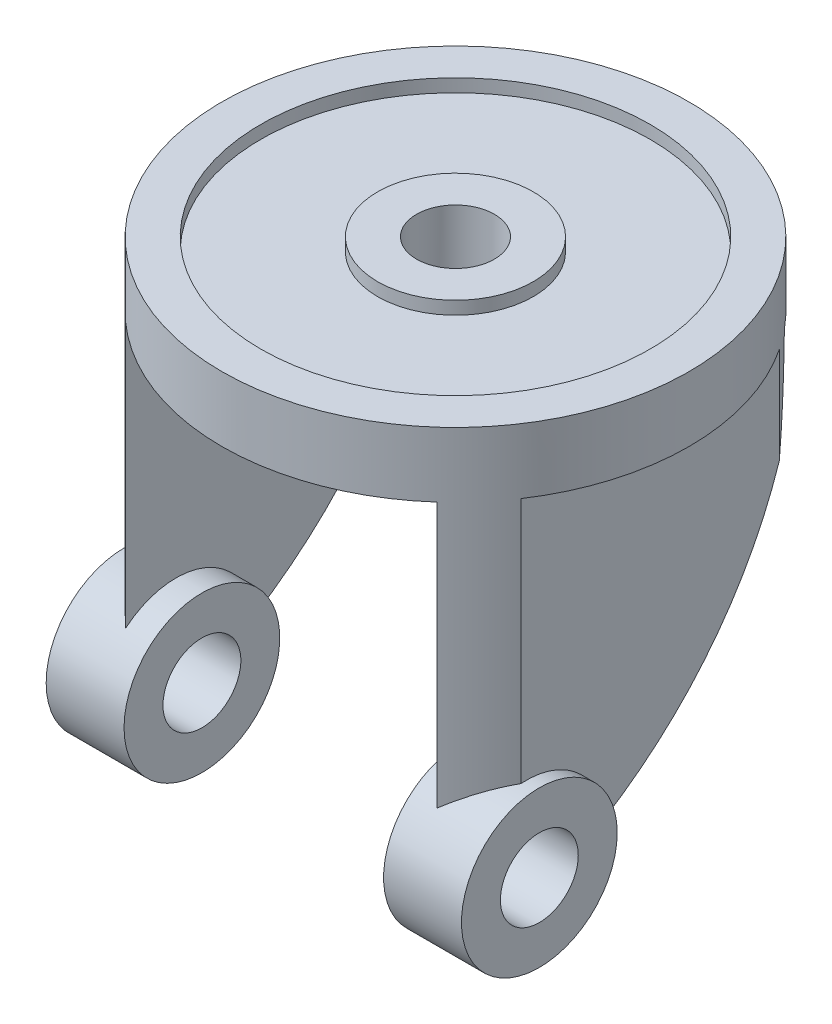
ISO-10303-21;
HEADER;
FILE_DESCRIPTION(('STEP AP214'),'2;1');
FILE_NAME('part.step','',(''),(''),'','','');
FILE_SCHEMA(('AUTOMOTIVE_DESIGN { 1 0 10303 214 1 1 1 1 }'));
ENDSEC;
DATA;
#1=APPLICATION_CONTEXT('core data for automotive mechanical design processes');
#2=APPLICATION_PROTOCOL_DEFINITION('international standard','automotive_design',2000,#1);
#3=PRODUCT_CONTEXT('',#1,'mechanical');
#4=PRODUCT('Part','Part','',(#3));
#5=PRODUCT_RELATED_PRODUCT_CATEGORY('part','',(#4));
#6=PRODUCT_DEFINITION_FORMATION('','',#4);
#7=PRODUCT_DEFINITION_CONTEXT('part definition',#1,'design');
#8=PRODUCT_DEFINITION('design','',#6,#7);
#9=PRODUCT_DEFINITION_SHAPE('','',#8);
#10=(LENGTH_UNIT() NAMED_UNIT(*) SI_UNIT(.MILLI.,.METRE.));
#11=(NAMED_UNIT(*) PLANE_ANGLE_UNIT() SI_UNIT($,.RADIAN.));
#12=(NAMED_UNIT(*) SI_UNIT($,.STERADIAN.) SOLID_ANGLE_UNIT());
#13=UNCERTAINTY_MEASURE_WITH_UNIT(LENGTH_MEASURE(1.E-05),#10,'distance_accuracy_value','');
#14=(GEOMETRIC_REPRESENTATION_CONTEXT(3) GLOBAL_UNCERTAINTY_ASSIGNED_CONTEXT((#13)) GLOBAL_UNIT_ASSIGNED_CONTEXT((#10,
#11,#12)) REPRESENTATION_CONTEXT('',''));
#15=CARTESIAN_POINT('',(0.,0.,0.));
#16=DIRECTION('',(0.,0.,1.));
#17=DIRECTION('',(1.,0.,0.));
#18=AXIS2_PLACEMENT_3D('',#15,#16,#17);
#19=CARTESIAN_POINT('',(0.,1.,-28.6156217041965));
#20=DIRECTION('',(0.,1.,0.));
#21=DIRECTION('',(0.,0.,1.));
#22=AXIS2_PLACEMENT_3D('',#19,#20,#21);
#23=CYLINDRICAL_SURFACE('',#22,9.);
#24=CARTESIAN_POINT('',(0.,90.,-28.6156217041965));
#25=DIRECTION('',(0.,1.,0.));
#26=DIRECTION('',(0.,0.,1.));
#27=AXIS2_PLACEMENT_3D('',#24,#25,#26);
#28=CIRCLE('',#27,9.);
#29=CARTESIAN_POINT('',(0.,90.,-19.6156217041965));
#30=VERTEX_POINT('',#29);
#31=EDGE_CURVE('E174',#30,#30,#28,.T.);
#32=ORIENTED_EDGE('',*,*,#31,.T.);
#33=EDGE_LOOP('',(#32));
#34=FACE_BOUND('',#33,.T.);
#35=CARTESIAN_POINT('',(0.,76.5,-28.6156217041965));
#36=DIRECTION('',(0.,-1.,0.));
#37=DIRECTION('',(0.,0.,-1.));
#38=AXIS2_PLACEMENT_3D('',#35,#36,#37);
#39=CIRCLE('',#38,9.);
#40=CARTESIAN_POINT('',(0.,76.5,-37.6156217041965));
#41=VERTEX_POINT('',#40);
#42=EDGE_CURVE('E38',#41,#41,#39,.F.);
#43=ORIENTED_EDGE('',*,*,#42,.F.);
#44=EDGE_LOOP('',(#43));
#45=FACE_BOUND('',#44,.T.);
#46=ADVANCED_FACE('F34',(#34,#45),#23,.F.);
#47=CARTESIAN_POINT('',(0.,90.,-28.6156217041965));
#48=DIRECTION('',(0.,1.,0.));
#49=DIRECTION('',(0.,0.,1.));
#50=AXIS2_PLACEMENT_3D('',#47,#48,#49);
#51=PLANE('',#50);
#52=ORIENTED_EDGE('',*,*,#31,.F.);
#53=EDGE_LOOP('',(#52));
#54=FACE_BOUND('',#53,.T.);
#55=CARTESIAN_POINT('',(0.,90.,-28.6156217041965));
#56=DIRECTION('',(0.,1.,0.));
#57=DIRECTION('',(0.,0.,1.));
#58=AXIS2_PLACEMENT_3D('',#55,#56,#57);
#59=CIRCLE('',#58,18.);
#60=CARTESIAN_POINT('',(0.,90.,-10.6156217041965));
#61=VERTEX_POINT('',#60);
#62=EDGE_CURVE('E368',#61,#61,#59,.T.);
#63=ORIENTED_EDGE('',*,*,#62,.T.);
#64=EDGE_LOOP('',(#63));
#65=FACE_BOUND('',#64,.T.);
#66=ADVANCED_FACE('F251',(#54,#65),#51,.T.);
#67=CARTESIAN_POINT('',(48.,0.,0.));
#68=DIRECTION('',(-1.,0.,0.));
#69=DIRECTION('',(0.,0.,1.));
#70=AXIS2_PLACEMENT_3D('',#67,#68,#69);
#71=CYLINDRICAL_SURFACE('',#70,18.);
#72=CARTESIAN_POINT('',(-30.,0.,0.));
#73=DIRECTION('',(-1.,0.,0.));
#74=DIRECTION('',(0.,0.,1.));
#75=AXIS2_PLACEMENT_3D('',#72,#73,#74);
#76=CIRCLE('',#75,18.);
#77=CARTESIAN_POINT('',(-30.,0.,18.));
#78=VERTEX_POINT('',#77);
#79=EDGE_CURVE('E124',#78,#78,#76,.T.);
#80=ORIENTED_EDGE('',*,*,#79,.T.);
#81=EDGE_LOOP('',(#80));
#82=FACE_BOUND('',#81,.T.);
#83=CARTESIAN_POINT('',(-48.,0.,0.));
#84=DIRECTION('',(1.,0.,0.));
#85=DIRECTION('',(0.,0.,-1.));
#86=AXIS2_PLACEMENT_3D('',#83,#84,#85);
#87=CIRCLE('',#86,18.);
#88=CARTESIAN_POINT('',(-48.,0.,-18.));
#89=VERTEX_POINT('',#88);
#90=EDGE_CURVE('E161',#89,#89,#87,.T.);
#91=ORIENTED_EDGE('',*,*,#90,.T.);
#92=EDGE_LOOP('',(#91));
#93=FACE_BOUND('',#92,.T.);
#94=CARTESIAN_POINT('',(-36.,0.,0.));
#95=DIRECTION('',(-1.,0.,0.));
#96=DIRECTION('',(0.,0.,-1.));
#97=AXIS2_PLACEMENT_3D('',#94,#95,#96);
#98=CIRCLE('',#97,18.);
#99=CARTESIAN_POINT('',(-36.,13.735330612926,11.6336018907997));
#100=VERTEX_POINT('',#99);
#101=CARTESIAN_POINT('',(-36.,1.26427087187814,-17.9555456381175));
#102=VERTEX_POINT('',#101);
#103=EDGE_CURVE('E309',#100,#102,#98,.T.);
#104=ORIENTED_EDGE('',*,*,#103,.F.);
#105=CARTESIAN_POINT('',(-45.,-17.9576513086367,1.23400140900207));
#106=CARTESIAN_POINT('',(-44.7881164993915,-17.9356977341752,1.55344461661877));
#107=CARTESIAN_POINT('',(-44.5731004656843,-17.9053703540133,1.87019320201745));
#108=CARTESIAN_POINT('',(-44.1373695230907,-17.8286692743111,2.49769093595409));
#109=CARTESIAN_POINT('',(-43.9166556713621,-17.7822985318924,2.8084411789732));
#110=CARTESIAN_POINT('',(-43.4702632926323,-17.6742630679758,3.42311076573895));
#111=CARTESIAN_POINT('',(-43.2445905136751,-17.6126152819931,3.72703726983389));
#112=CARTESIAN_POINT('',(-42.7885762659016,-17.4746601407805,4.32796759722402));
#113=CARTESIAN_POINT('',(-42.558234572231,-17.3983520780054,4.62497108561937));
#114=CARTESIAN_POINT('',(-41.8626138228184,-17.1489595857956,5.5029566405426));
#115=CARTESIAN_POINT('',(-41.3910741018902,-16.9549960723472,6.0732014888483));
#116=CARTESIAN_POINT('',(-40.435459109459,-16.5156578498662,7.18256428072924));
#117=CARTESIAN_POINT('',(-39.9513802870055,-16.2702684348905,7.72167326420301));
#118=CARTESIAN_POINT('',(-38.9853167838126,-15.737353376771,8.75595725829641));
#119=CARTESIAN_POINT('',(-38.5035122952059,-15.4508511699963,9.25182924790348));
#120=CARTESIAN_POINT('',(-37.5357681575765,-14.8342332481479,10.2113067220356));
#121=CARTESIAN_POINT('',(-37.0498285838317,-14.5041183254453,10.6749127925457));
#122=CARTESIAN_POINT('',(-36.077466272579,-13.8010195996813,11.5696183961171));
#123=CARTESIAN_POINT('',(-35.5910437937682,-13.4279772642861,12.0006721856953));
#124=CARTESIAN_POINT('',(-34.623540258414,-12.63947550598,12.8285023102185));
#125=CARTESIAN_POINT('',(-34.1424580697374,-12.2240252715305,13.225286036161));
#126=CARTESIAN_POINT('',(-33.3179975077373,-11.4651789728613,13.8827417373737));
#127=CARTESIAN_POINT('',(-32.9718889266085,-11.131834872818,14.1516335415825));
#128=CARTESIAN_POINT('',(-32.2893692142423,-10.4402951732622,14.6692478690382));
#129=CARTESIAN_POINT('',(-31.9529586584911,-10.0820981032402,14.9179691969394));
#130=CARTESIAN_POINT('',(-31.2947563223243,-9.33992106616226,15.3935001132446));
#131=CARTESIAN_POINT('',(-30.9729418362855,-8.95598362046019,15.6203443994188));
#132=CARTESIAN_POINT('',(-30.3491938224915,-8.15987052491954,16.0505813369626));
#133=CARTESIAN_POINT('',(-30.0472516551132,-7.74770730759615,16.2539842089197));
#134=CARTESIAN_POINT('',(-29.5744617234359,-7.04625366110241,16.5662377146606));
#135=CARTESIAN_POINT('',(-29.3954339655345,-6.76590784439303,16.6828368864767));
#136=CARTESIAN_POINT('',(-29.0514563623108,-6.19212412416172,16.9042053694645));
#137=CARTESIAN_POINT('',(-28.8865063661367,-5.89868636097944,17.0089748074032));
#138=CARTESIAN_POINT('',(-28.5740666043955,-5.29879068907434,17.2052986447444));
#139=CARTESIAN_POINT('',(-28.4265571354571,-4.99234801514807,17.2968679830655));
#140=CARTESIAN_POINT('',(-28.1525522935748,-4.36635865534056,17.4653904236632));
#141=CARTESIAN_POINT('',(-28.0260478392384,-4.04681770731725,17.5423498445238));
#142=CARTESIAN_POINT('',(-27.8231354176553,-3.46696745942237,17.6648704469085));
#143=CARTESIAN_POINT('',(-27.7418258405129,-3.20904570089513,17.7136158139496));
#144=CARTESIAN_POINT('',(-27.5965013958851,-2.6867050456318,17.8003268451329));
#145=CARTESIAN_POINT('',(-27.5324769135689,-2.42228985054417,17.8382985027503));
#146=CARTESIAN_POINT('',(-27.4235508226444,-1.88840423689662,17.9026852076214));
#147=CARTESIAN_POINT('',(-27.3786305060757,-1.61893903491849,17.9291115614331));
#148=CARTESIAN_POINT('',(-27.3092695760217,-1.07645228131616,17.9698419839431));
#149=CARTESIAN_POINT('',(-27.284828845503,-0.803430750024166,17.9841461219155));
#150=CARTESIAN_POINT('',(-27.2572248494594,-0.254771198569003,18.0002978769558));
#151=CARTESIAN_POINT('',(-27.2541523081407,0.0208730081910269,18.0020923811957));
#152=CARTESIAN_POINT('',(-27.2696364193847,0.571332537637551,17.9930363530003));
#153=CARTESIAN_POINT('',(-27.2881927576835,0.846147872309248,17.9821860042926));
#154=CARTESIAN_POINT('',(-27.3462958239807,1.39299030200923,17.9481112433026));
#155=CARTESIAN_POINT('',(-27.3858602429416,1.665014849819,17.9248764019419));
#156=CARTESIAN_POINT('',(-27.4846643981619,2.20416513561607,17.86659529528));
#157=CARTESIAN_POINT('',(-27.5439067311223,2.4712902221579,17.8315474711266));
#158=CARTESIAN_POINT('',(-27.6965996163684,3.06221513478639,17.7406940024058));
#159=CARTESIAN_POINT('',(-27.7948399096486,3.3843262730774,17.6819305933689));
#160=CARTESIAN_POINT('',(-28.0150222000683,4.01698233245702,17.5490306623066));
#161=CARTESIAN_POINT('',(-28.1369707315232,4.32752403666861,17.4748899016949));
#162=CARTESIAN_POINT('',(-28.5330897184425,5.24151773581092,17.2314951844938));
#163=CARTESIAN_POINT('',(-28.8373157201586,5.82655919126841,17.0413951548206));
#164=CARTESIAN_POINT('',(-29.4401584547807,6.84621874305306,16.6544788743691));
#165=CARTESIAN_POINT('',(-29.7300719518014,7.28904033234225,16.4649265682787));
#166=CARTESIAN_POINT('',(-30.336185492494,8.14386502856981,16.0593018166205));
#167=CARTESIAN_POINT('',(-30.6524025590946,8.55584784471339,15.8432121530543));
#168=CARTESIAN_POINT('',(-31.3041527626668,9.35195315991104,15.3867520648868));
#169=CARTESIAN_POINT('',(-31.63973565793,9.73599758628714,15.1463177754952));
#170=CARTESIAN_POINT('',(-32.3238362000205,10.4770673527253,14.6434792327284));
#171=CARTESIAN_POINT('',(-32.6723525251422,10.8340954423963,14.3810772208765));
#172=CARTESIAN_POINT('',(-33.2925707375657,11.4391683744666,13.901657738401));
#173=CARTESIAN_POINT('',(-33.5624168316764,11.6926542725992,13.6890550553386));
#174=CARTESIAN_POINT('',(-34.1057196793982,12.1854603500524,13.2522819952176));
#175=CARTESIAN_POINT('',(-34.3791767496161,12.4247792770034,13.0281105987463));
#176=CARTESIAN_POINT('',(-34.928527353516,12.8895842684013,12.5684321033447));
#177=CARTESIAN_POINT('',(-35.2044216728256,13.1150656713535,12.3329212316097));
#178=CARTESIAN_POINT('',(-35.7575028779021,13.5522366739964,11.8508540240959));
#179=CARTESIAN_POINT('',(-36.0346898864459,13.7639249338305,11.6042966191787));
#180=CARTESIAN_POINT('',(-36.8656806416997,14.3775133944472,10.8493064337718));
#181=CARTESIAN_POINT('',(-37.4200673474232,14.7589057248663,10.3245958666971));
#182=CARTESIAN_POINT('',(-38.523461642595,15.4650342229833,9.23335530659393));
#183=CARTESIAN_POINT('',(-39.0724702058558,15.7897808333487,8.66683304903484));
#184=CARTESIAN_POINT('',(-40.0909789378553,16.342142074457,7.56727865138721));
#185=CARTESIAN_POINT('',(-40.5617870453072,16.5768381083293,7.03900982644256));
#186=CARTESIAN_POINT('',(-41.4911600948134,16.9970519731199,5.95306102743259));
#187=CARTESIAN_POINT('',(-41.9497294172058,17.1825876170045,5.39539179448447));
#188=CARTESIAN_POINT('',(-42.6260502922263,17.4211417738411,4.53785491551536));
#189=CARTESIAN_POINT('',(-42.8498310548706,17.4940987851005,4.24814197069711));
#190=CARTESIAN_POINT('',(-43.2929300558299,17.6260758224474,3.66218896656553));
#191=CARTESIAN_POINT('',(-43.5122485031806,17.6850965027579,3.36594921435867));
#192=CARTESIAN_POINT('',(-43.946177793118,17.7886496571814,2.76702180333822));
#193=CARTESIAN_POINT('',(-44.1607830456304,17.8331657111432,2.46432724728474));
#194=CARTESIAN_POINT('',(-44.5845820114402,17.9069843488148,1.8532732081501));
#195=CARTESIAN_POINT('',(-44.7937747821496,17.9362842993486,1.54491275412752));
#196=CARTESIAN_POINT('',(-45.0000000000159,17.9576513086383,1.23400140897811));
#197=B_SPLINE_CURVE_WITH_KNOTS('',3,(#105,#106,#107,#108,#109,#110,#111,#112,#113,#114,#115,
#116,#117,#118,#119,#120,#121,#122,#123,#124,#125,#126,#127,#128,#129,#130,#131,#132,#133,#134,
#135,#136,#137,#138,#139,#140,#141,#142,#143,#144,#145,#146,#147,#148,#149,#150,#151,#152,#153,
#154,#155,#156,#157,#158,#159,#160,#161,#162,#163,#164,#165,#166,#167,#168,#169,#170,#171,#172,
#173,#174,#175,#176,#177,#178,#179,#180,#181,#182,#183,#184,#185,#186,#187,#188,#189,#190,#191,
#192,#193,#194,#195,#196),.UNSPECIFIED.,.F.,.F.,(4,2,2,2,2,2,2,2,2,2,2,2,2,2,2,2,2,2,2,2,2,2,2,
2,2,2,2,2,2,2,2,2,2,2,2,2,2,2,2,2,2,2,2,2,2,4),(0.,1.15169643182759,2.30318069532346,
3.45339413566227,4.60366310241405,6.89565236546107,9.18829795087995,11.4314743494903,
13.6746099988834,15.9208412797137,18.1665869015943,19.8176448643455,21.4688006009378,
23.1172929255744,24.7650637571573,25.8218953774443,26.8787156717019,27.9343303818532,
28.9894875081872,29.8131245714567,30.6363025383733,31.4586725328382,32.2810378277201,
33.1068925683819,33.9327353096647,34.7592746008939,35.5859230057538,36.6098547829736,
37.6340691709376,39.6849241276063,41.369479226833,43.0551331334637,44.7453297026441,
46.4353540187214,47.7157609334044,48.9962808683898,50.2772298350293,51.5583030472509,
54.1151083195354,56.6714417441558,58.9059355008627,61.1396184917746,62.2591611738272,
63.3786512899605,64.4994043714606,65.6203513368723),.UNSPECIFIED.);
#198=CARTESIAN_POINT('',(-45.,17.9576513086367,1.23400140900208));
#199=VERTEX_POINT('',#198);
#200=EDGE_CURVE('E123',#100,#199,#197,.T.);
#201=ORIENTED_EDGE('',*,*,#200,.T.);
#202=CARTESIAN_POINT('',(-45.,0.,0.));
#203=DIRECTION('',(-1.,0.,0.));
#204=DIRECTION('',(0.,0.,-1.));
#205=AXIS2_PLACEMENT_3D('',#202,#203,#204);
#206=CIRCLE('',#205,18.);
#207=CARTESIAN_POINT('',(-45.,1.26427087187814,-17.9555456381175));
#208=VERTEX_POINT('',#207);
#209=EDGE_CURVE('E59',#199,#208,#206,.T.);
#210=ORIENTED_EDGE('',*,*,#209,.T.);
#211=DIRECTION('',(-1.,0.,0.));
#212=VECTOR('',#211,1.);
#213=CARTESIAN_POINT('',(-36.,1.26427087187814,-17.9555456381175));
#214=LINE('',#213,#212);
#215=EDGE_CURVE('E311',#102,#208,#214,.T.);
#216=ORIENTED_EDGE('',*,*,#215,.F.);
#217=EDGE_LOOP('',(#104,#201,#210,#216));
#218=FACE_BOUND('',#217,.T.);
#219=ADVANCED_FACE('F286',(#82,#93,#218),#71,.T.);
#220=CARTESIAN_POINT('',(48.,0.,0.));
#221=DIRECTION('',(-1.,0.,0.));
#222=DIRECTION('',(0.,0.,1.));
#223=AXIS2_PLACEMENT_3D('',#220,#221,#222);
#224=CYLINDRICAL_SURFACE('',#223,9.);
#225=CARTESIAN_POINT('',(-30.,0.,0.));
#226=DIRECTION('',(-1.,0.,0.));
#227=DIRECTION('',(0.,0.,1.));
#228=AXIS2_PLACEMENT_3D('',#225,#226,#227);
#229=CIRCLE('',#228,9.);
#230=CARTESIAN_POINT('',(-30.,0.,9.));
#231=VERTEX_POINT('',#230);
#232=EDGE_CURVE('E175',#231,#231,#229,.T.);
#233=ORIENTED_EDGE('',*,*,#232,.F.);
#234=EDGE_LOOP('',(#233));
#235=FACE_BOUND('',#234,.T.);
#236=CARTESIAN_POINT('',(-48.,0.,0.));
#237=DIRECTION('',(1.,0.,0.));
#238=DIRECTION('',(0.,0.,-1.));
#239=AXIS2_PLACEMENT_3D('',#236,#237,#238);
#240=CIRCLE('',#239,9.);
#241=CARTESIAN_POINT('',(-48.,0.,-9.));
#242=VERTEX_POINT('',#241);
#243=EDGE_CURVE('E156',#242,#242,#240,.T.);
#244=ORIENTED_EDGE('',*,*,#243,.F.);
#245=EDGE_LOOP('',(#244));
#246=FACE_BOUND('',#245,.T.);
#247=ADVANCED_FACE('F255',(#235,#246),#224,.F.);
#248=CARTESIAN_POINT('',(0.,75.,-28.6156217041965));
#249=DIRECTION('',(0.,1.,0.));
#250=DIRECTION('',(0.,0.,1.));
#251=AXIS2_PLACEMENT_3D('',#248,#249,#250);
#252=CYLINDRICAL_SURFACE('',#251,54.);
#253=CARTESIAN_POINT('',(0.,90.,-28.6156217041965));
#254=DIRECTION('',(0.,1.,0.));
#255=DIRECTION('',(0.,0.,1.));
#256=AXIS2_PLACEMENT_3D('',#253,#254,#255);
#257=CIRCLE('',#256,54.);
#258=CARTESIAN_POINT('',(0.,90.,25.3843782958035));
#259=VERTEX_POINT('',#258);
#260=EDGE_CURVE('E325',#259,#259,#257,.T.);
#261=ORIENTED_EDGE('',*,*,#260,.F.);
#262=EDGE_LOOP('',(#261));
#263=FACE_BOUND('',#262,.T.);
#264=DIRECTION('',(0.,1.,0.));
#265=VECTOR('',#264,1.);
#266=CARTESIAN_POINT('',(36.,-18.001,11.6336018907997));
#267=LINE('',#266,#265);
#268=CARTESIAN_POINT('',(36.,13.735330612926,11.6336018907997));
#269=VERTEX_POINT('',#268);
#270=CARTESIAN_POINT('',(36.,75.,11.6336018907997));
#271=VERTEX_POINT('',#270);
#272=EDGE_CURVE('E119',#269,#271,#267,.T.);
#273=ORIENTED_EDGE('',*,*,#272,.F.);
#274=CARTESIAN_POINT('',(45.,17.9576513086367,1.23400140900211));
#275=CARTESIAN_POINT('',(44.7881164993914,17.9356977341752,1.55344461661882));
#276=CARTESIAN_POINT('',(44.5731004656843,17.9053703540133,1.8701932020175));
#277=CARTESIAN_POINT('',(44.1373695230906,17.8286692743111,2.49769093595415));
#278=CARTESIAN_POINT('',(43.916655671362,17.7822985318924,2.80844117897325));
#279=CARTESIAN_POINT('',(43.4702632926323,17.6742630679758,3.42311076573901));
#280=CARTESIAN_POINT('',(43.244590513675,17.6126152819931,3.72703726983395));
#281=CARTESIAN_POINT('',(42.7885762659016,17.4746601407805,4.32796759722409));
#282=CARTESIAN_POINT('',(42.5582345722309,17.3983520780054,4.62497108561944));
#283=CARTESIAN_POINT('',(41.8626138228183,17.1489595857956,5.50295664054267));
#284=CARTESIAN_POINT('',(41.3910741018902,16.9549960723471,6.07320148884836));
#285=CARTESIAN_POINT('',(40.435459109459,16.5156578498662,7.1825642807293));
#286=CARTESIAN_POINT('',(39.9513802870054,16.2702684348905,7.72167326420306));
#287=CARTESIAN_POINT('',(38.9853167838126,15.737353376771,8.75595725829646));
#288=CARTESIAN_POINT('',(38.5035122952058,15.4508511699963,9.25182924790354));
#289=CARTESIAN_POINT('',(37.5357681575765,14.8342332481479,10.2113067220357));
#290=CARTESIAN_POINT('',(37.0498285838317,14.5041183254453,10.6749127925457));
#291=CARTESIAN_POINT('',(36.0774662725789,13.8010195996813,11.5696183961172));
#292=CARTESIAN_POINT('',(35.5910437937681,13.427977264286,12.0006721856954));
#293=CARTESIAN_POINT('',(34.623540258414,12.6394755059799,12.8285023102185));
#294=CARTESIAN_POINT('',(34.1424580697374,12.2240252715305,13.225286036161));
#295=CARTESIAN_POINT('',(33.3179975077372,11.4651789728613,13.8827417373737));
#296=CARTESIAN_POINT('',(32.9718889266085,11.131834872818,14.1516335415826));
#297=CARTESIAN_POINT('',(32.2893692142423,10.4402951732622,14.6692478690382));
#298=CARTESIAN_POINT('',(31.952958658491,10.0820981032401,14.9179691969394));
#299=CARTESIAN_POINT('',(31.2947563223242,9.33992106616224,15.3935001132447));
#300=CARTESIAN_POINT('',(30.9729418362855,8.95598362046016,15.6203443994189));
#301=CARTESIAN_POINT('',(30.3491938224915,8.15987052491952,16.0505813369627));
#302=CARTESIAN_POINT('',(30.0472516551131,7.74770730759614,16.2539842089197));
#303=CARTESIAN_POINT('',(29.5744617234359,7.0462536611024,16.5662377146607));
#304=CARTESIAN_POINT('',(29.3954339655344,6.76590784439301,16.6828368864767));
#305=CARTESIAN_POINT('',(29.0514563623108,6.1921241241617,16.9042053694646));
#306=CARTESIAN_POINT('',(28.8865063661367,5.89868636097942,17.0089748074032));
#307=CARTESIAN_POINT('',(28.5740666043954,5.29879068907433,17.2052986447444));
#308=CARTESIAN_POINT('',(28.426557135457,4.99234801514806,17.2968679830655));
#309=CARTESIAN_POINT('',(28.1525522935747,4.36635865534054,17.4653904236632));
#310=CARTESIAN_POINT('',(28.0260478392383,4.04681770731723,17.5423498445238));
#311=CARTESIAN_POINT('',(27.8231354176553,3.46696745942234,17.6648704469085));
#312=CARTESIAN_POINT('',(27.7418258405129,3.2090457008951,17.7136158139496));
#313=CARTESIAN_POINT('',(27.596501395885,2.68670504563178,17.8003268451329));
#314=CARTESIAN_POINT('',(27.5324769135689,2.42228985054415,17.8382985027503));
#315=CARTESIAN_POINT('',(27.4235508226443,1.8884042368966,17.9026852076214));
#316=CARTESIAN_POINT('',(27.3786305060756,1.61893903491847,17.9291115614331));
#317=CARTESIAN_POINT('',(27.3092695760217,1.07645228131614,17.9698419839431));
#318=CARTESIAN_POINT('',(27.284828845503,0.803430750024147,17.9841461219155));
#319=CARTESIAN_POINT('',(27.2572248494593,0.254771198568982,18.0002978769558));
#320=CARTESIAN_POINT('',(27.2541523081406,-0.0208730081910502,18.0020923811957));
#321=CARTESIAN_POINT('',(27.2696364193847,-0.571332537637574,17.9930363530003));
#322=CARTESIAN_POINT('',(27.2881927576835,-0.846147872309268,17.9821860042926));
#323=CARTESIAN_POINT('',(27.3462958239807,-1.39299030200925,17.9481112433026));
#324=CARTESIAN_POINT('',(27.3858602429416,-1.66501484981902,17.9248764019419));
#325=CARTESIAN_POINT('',(27.4846643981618,-2.20416513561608,17.86659529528));
#326=CARTESIAN_POINT('',(27.5439067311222,-2.47129022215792,17.8315474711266));
#327=CARTESIAN_POINT('',(27.6965996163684,-3.0622151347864,17.7406940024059));
#328=CARTESIAN_POINT('',(27.7948399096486,-3.38432627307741,17.6819305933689));
#329=CARTESIAN_POINT('',(28.0150222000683,-4.01698233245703,17.5490306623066));
#330=CARTESIAN_POINT('',(28.1369707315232,-4.32752403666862,17.4748899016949));
#331=CARTESIAN_POINT('',(28.5330897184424,-5.24151773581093,17.2314951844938));
#332=CARTESIAN_POINT('',(28.8373157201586,-5.82655919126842,17.0413951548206));
#333=CARTESIAN_POINT('',(29.4401584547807,-6.84621874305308,16.6544788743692));
#334=CARTESIAN_POINT('',(29.7300719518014,-7.28904033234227,16.4649265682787));
#335=CARTESIAN_POINT('',(30.336185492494,-8.14386502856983,16.0593018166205));
#336=CARTESIAN_POINT('',(30.6524025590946,-8.5558478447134,15.8432121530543));
#337=CARTESIAN_POINT('',(31.3041527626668,-9.35195315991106,15.3867520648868));
#338=CARTESIAN_POINT('',(31.63973565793,-9.73599758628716,15.1463177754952));
#339=CARTESIAN_POINT('',(32.3238362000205,-10.4770673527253,14.6434792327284));
#340=CARTESIAN_POINT('',(32.6723525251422,-10.8340954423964,14.3810772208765));
#341=CARTESIAN_POINT('',(33.2925707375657,-11.4391683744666,13.901657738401));
#342=CARTESIAN_POINT('',(33.5624168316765,-11.6926542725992,13.6890550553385));
#343=CARTESIAN_POINT('',(34.1057196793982,-12.1854603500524,13.2522819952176));
#344=CARTESIAN_POINT('',(34.3791767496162,-12.4247792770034,13.0281105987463));
#345=CARTESIAN_POINT('',(34.928527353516,-12.8895842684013,12.5684321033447));
#346=CARTESIAN_POINT('',(35.2044216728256,-13.1150656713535,12.3329212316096));
#347=CARTESIAN_POINT('',(35.7575028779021,-13.5522366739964,11.8508540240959));
#348=CARTESIAN_POINT('',(36.0346898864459,-13.7639249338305,11.6042966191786));
#349=CARTESIAN_POINT('',(36.8656806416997,-14.3775133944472,10.8493064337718));
#350=CARTESIAN_POINT('',(37.4200673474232,-14.7589057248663,10.3245958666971));
#351=CARTESIAN_POINT('',(38.523461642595,-15.4650342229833,9.23335530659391));
#352=CARTESIAN_POINT('',(39.0724702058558,-15.7897808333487,8.66683304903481));
#353=CARTESIAN_POINT('',(40.0909789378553,-16.342142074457,7.56727865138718));
#354=CARTESIAN_POINT('',(40.5617870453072,-16.5768381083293,7.03900982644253));
#355=CARTESIAN_POINT('',(41.4911600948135,-16.9970519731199,5.95306102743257));
#356=CARTESIAN_POINT('',(41.9497294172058,-17.1825876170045,5.39539179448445));
#357=CARTESIAN_POINT('',(42.6260502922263,-17.4211417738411,4.53785491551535));
#358=CARTESIAN_POINT('',(42.8498310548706,-17.4940987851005,4.2481419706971));
#359=CARTESIAN_POINT('',(43.2929300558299,-17.6260758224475,3.66218896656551));
#360=CARTESIAN_POINT('',(43.5122485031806,-17.6850965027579,3.36594921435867));
#361=CARTESIAN_POINT('',(43.946177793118,-17.7886496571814,2.76702180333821));
#362=CARTESIAN_POINT('',(44.1607830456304,-17.8331657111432,2.46432724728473));
#363=CARTESIAN_POINT('',(44.5845820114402,-17.9069843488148,1.85327320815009));
#364=CARTESIAN_POINT('',(44.7937747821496,-17.9362842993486,1.54491275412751));
#365=CARTESIAN_POINT('',(45.0000000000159,-17.9576513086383,1.23400140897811));
#366=B_SPLINE_CURVE_WITH_KNOTS('',3,(#274,#275,#276,#277,#278,#279,#280,#281,#282,#283,#284,
#285,#286,#287,#288,#289,#290,#291,#292,#293,#294,#295,#296,#297,#298,#299,#300,#301,#302,#303,
#304,#305,#306,#307,#308,#309,#310,#311,#312,#313,#314,#315,#316,#317,#318,#319,#320,#321,#322,
#323,#324,#325,#326,#327,#328,#329,#330,#331,#332,#333,#334,#335,#336,#337,#338,#339,#340,#341,
#342,#343,#344,#345,#346,#347,#348,#349,#350,#351,#352,#353,#354,#355,#356,#357,#358,#359,#360,
#361,#362,#363,#364,#365),.UNSPECIFIED.,.F.,.F.,(4,2,2,2,2,2,2,2,2,2,2,2,2,2,2,2,2,2,2,2,2,2,2,
2,2,2,2,2,2,2,2,2,2,2,2,2,2,2,2,2,2,2,2,2,2,4),(0.,1.15169643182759,2.30318069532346,
3.45339413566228,4.60366310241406,6.89565236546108,9.18829795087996,11.4314743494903,
13.6746099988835,15.9208412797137,18.1665869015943,19.8176448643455,21.4688006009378,
23.1172929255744,24.7650637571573,25.8218953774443,26.8787156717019,27.9343303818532,
28.9894875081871,29.8131245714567,30.6363025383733,31.4586725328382,32.2810378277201,
33.1068925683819,33.9327353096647,34.7592746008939,35.5859230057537,36.6098547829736,
37.6340691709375,39.6849241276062,41.369479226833,43.0551331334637,44.7453297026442,
46.4353540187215,47.7157609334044,48.9962808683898,50.2772298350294,51.5583030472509,
54.1151083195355,56.6714417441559,58.9059355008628,61.1396184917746,62.2591611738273,
63.3786512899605,64.4994043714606,65.6203513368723),.UNSPECIFIED.);
#367=CARTESIAN_POINT('',(45.,17.9576513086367,1.23400140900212));
#368=VERTEX_POINT('',#367);
#369=EDGE_CURVE('E112',#368,#269,#366,.T.);
#370=ORIENTED_EDGE('',*,*,#369,.F.);
#371=DIRECTION('',(0.,1.,0.));
#372=VECTOR('',#371,1.);
#373=CARTESIAN_POINT('',(45.,-18.001,1.23400140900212));
#374=LINE('',#373,#372);
#375=CARTESIAN_POINT('',(45.,75.,1.2340014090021));
#376=VERTEX_POINT('',#375);
#377=EDGE_CURVE('E116',#368,#376,#374,.T.);
#378=ORIENTED_EDGE('',*,*,#377,.T.);
#379=CARTESIAN_POINT('',(0.,75.,-28.6156217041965));
#380=DIRECTION('',(0.,1.,0.));
#381=DIRECTION('',(0.,0.,1.));
#382=AXIS2_PLACEMENT_3D('',#379,#380,#381);
#383=CIRCLE('',#382,54.);
#384=CARTESIAN_POINT('',(45.,75.,-58.4652448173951));
#385=VERTEX_POINT('',#384);
#386=EDGE_CURVE('E141',#376,#385,#383,.T.);
#387=ORIENTED_EDGE('',*,*,#386,.T.);
#388=DIRECTION('',(0.,1.,0.));
#389=VECTOR('',#388,1.);
#390=CARTESIAN_POINT('',(45.,-18.001,-58.4652448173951));
#391=LINE('',#390,#389);
#392=CARTESIAN_POINT('',(45.,52.6838061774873,-58.4652448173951));
#393=VERTEX_POINT('',#392);
#394=EDGE_CURVE('E216',#393,#385,#391,.T.);
#395=ORIENTED_EDGE('',*,*,#394,.F.);
#396=CARTESIAN_POINT('',(45.,52.6838061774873,-58.4652448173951));
#397=CARTESIAN_POINT('',(44.8034016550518,53.5801105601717,-58.7616246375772));
#398=CARTESIAN_POINT('',(44.6111788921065,54.481569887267,-59.045060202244));
#399=CARTESIAN_POINT('',(44.2375212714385,56.2945949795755,-59.5857636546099));
#400=CARTESIAN_POINT('',(44.0560872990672,57.2061615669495,-59.8430293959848));
#401=CARTESIAN_POINT('',(43.5327602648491,59.9466528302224,-60.5727288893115));
#402=CARTESIAN_POINT('',(43.2099059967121,61.7900236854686,-61.0059294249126));
#403=CARTESIAN_POINT('',(42.7757992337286,64.5792277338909,-61.5744986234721));
#404=CARTESIAN_POINT('',(42.6394415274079,65.5131391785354,-61.7505048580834));
#405=CARTESIAN_POINT('',(42.3852323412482,67.3882660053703,-62.0750688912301));
#406=CARTESIAN_POINT('',(42.2673805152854,68.3294812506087,-62.2236272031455));
#407=CARTESIAN_POINT('',(42.0513653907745,70.2225883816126,-62.4935339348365));
#408=CARTESIAN_POINT('',(41.9532963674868,71.1745095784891,-62.6147523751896));
#409=CARTESIAN_POINT('',(41.7789210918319,73.0836196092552,-62.828775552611));
#410=CARTESIAN_POINT('',(41.7026170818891,74.0408089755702,-62.9215773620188));
#411=CARTESIAN_POINT('',(41.6378977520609,74.9999999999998,-63.));
#412=B_SPLINE_CURVE_WITH_KNOTS('',3,(#396,#397,#398,#399,#400,#401,#402,#403,#404,#405,#406,
#407,#408,#409,#410,#411),.UNSPECIFIED.,.F.,.F.,(4,2,2,2,2,2,2,4),(0.,2.89258335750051,
5.78540375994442,11.5431326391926,14.4229234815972,17.3026604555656,20.1958125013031,
23.0892625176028),.UNSPECIFIED.);
#413=CARTESIAN_POINT('',(41.6378977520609,75.,-63.));
#414=VERTEX_POINT('',#413);
#415=EDGE_CURVE('E210',#393,#414,#412,.T.);
#416=ORIENTED_EDGE('',*,*,#415,.T.);
#417=CARTESIAN_POINT('',(-41.6378977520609,75.0000000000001,-63.));
#418=VERTEX_POINT('',#417);
#419=EDGE_CURVE('E144',#414,#418,#383,.T.);
#420=ORIENTED_EDGE('',*,*,#419,.T.);
#421=CARTESIAN_POINT('',(-45.,52.6838061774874,-58.4652448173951));
#422=CARTESIAN_POINT('',(-44.8034016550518,53.5801105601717,-58.7616246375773));
#423=CARTESIAN_POINT('',(-44.6111788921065,54.4815698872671,-59.0450602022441));
#424=CARTESIAN_POINT('',(-44.2375212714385,56.2945949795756,-59.5857636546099));
#425=CARTESIAN_POINT('',(-44.0560872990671,57.2061615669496,-59.8430293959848));
#426=CARTESIAN_POINT('',(-43.532760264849,59.9466528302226,-60.5727288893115));
#427=CARTESIAN_POINT('',(-43.209905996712,61.7900236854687,-61.0059294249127));
#428=CARTESIAN_POINT('',(-42.7757992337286,64.5792277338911,-61.5744986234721));
#429=CARTESIAN_POINT('',(-42.6394415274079,65.5131391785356,-61.7505048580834));
#430=CARTESIAN_POINT('',(-42.3852323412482,67.3882660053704,-62.0750688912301));
#431=CARTESIAN_POINT('',(-42.2673805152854,68.3294812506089,-62.2236272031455));
#432=CARTESIAN_POINT('',(-42.0513653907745,70.2225883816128,-62.4935339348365));
#433=CARTESIAN_POINT('',(-41.9532963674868,71.1745095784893,-62.6147523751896));
#434=CARTESIAN_POINT('',(-41.7789210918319,73.0836196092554,-62.828775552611));
#435=CARTESIAN_POINT('',(-41.7026170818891,74.0408089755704,-62.9215773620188));
#436=CARTESIAN_POINT('',(-41.6378977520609,75.,-63.));
#437=B_SPLINE_CURVE_WITH_KNOTS('',3,(#421,#422,#423,#424,#425,#426,#427,#428,#429,#430,#431,
#432,#433,#434,#435,#436),.UNSPECIFIED.,.F.,.F.,(4,2,2,2,2,2,2,4),(0.,2.89258335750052,
5.78540375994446,11.5431326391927,14.4229234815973,17.3026604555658,20.1958125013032,
23.0892625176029),.UNSPECIFIED.);
#438=CARTESIAN_POINT('',(-45.,52.6838061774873,-58.4652448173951));
#439=VERTEX_POINT('',#438);
#440=EDGE_CURVE('E51',#439,#418,#437,.T.);
#441=ORIENTED_EDGE('',*,*,#440,.F.);
#442=DIRECTION('',(0.,1.,0.));
#443=VECTOR('',#442,1.);
#444=CARTESIAN_POINT('',(-45.,-18.001,-58.4652448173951));
#445=LINE('',#444,#443);
#446=CARTESIAN_POINT('',(-45.,75.,-58.4652448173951));
#447=VERTEX_POINT('',#446);
#448=EDGE_CURVE('E223',#439,#447,#445,.T.);
#449=ORIENTED_EDGE('',*,*,#448,.T.);
#450=CARTESIAN_POINT('',(-45.,75.,1.23400140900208));
#451=VERTEX_POINT('',#450);
#452=EDGE_CURVE('E328',#447,#451,#383,.T.);
#453=ORIENTED_EDGE('',*,*,#452,.T.);
#454=DIRECTION('',(0.,1.,0.));
#455=VECTOR('',#454,1.);
#456=CARTESIAN_POINT('',(-45.,-18.001,1.23400140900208));
#457=LINE('',#456,#455);
#458=EDGE_CURVE('E134',#199,#451,#457,.T.);
#459=ORIENTED_EDGE('',*,*,#458,.F.);
#460=ORIENTED_EDGE('',*,*,#200,.F.);
#461=DIRECTION('',(0.,1.,0.));
#462=VECTOR('',#461,1.);
#463=CARTESIAN_POINT('',(-36.,-18.001,11.6336018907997));
#464=LINE('',#463,#462);
#465=CARTESIAN_POINT('',(-36.,75.,11.6336018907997));
#466=VERTEX_POINT('',#465);
#467=EDGE_CURVE('E11',#466,#100,#464,.F.);
#468=ORIENTED_EDGE('',*,*,#467,.F.);
#469=EDGE_CURVE('E146',#466,#271,#383,.T.);
#470=ORIENTED_EDGE('',*,*,#469,.T.);
#471=EDGE_LOOP('',(#273,#370,#378,#387,#395,#416,#420,#441,#449,#453,#459,#460,#468,#470));
#472=FACE_BOUND('',#471,.T.);
#473=ADVANCED_FACE('F114',(#263,#472),#252,.T.);
#474=CARTESIAN_POINT('',(36.,82.8239173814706,32.6806475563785));
#475=DIRECTION('',(1.,0.,0.));
#476=DIRECTION('',(0.,0.,-1.));
#477=AXIS2_PLACEMENT_3D('',#474,#475,#476);
#478=CYLINDRICAL_SURFACE('',#477,96.);
#479=DIRECTION('',(1.,0.,0.));
#480=VECTOR('',#479,1.);
#481=CARTESIAN_POINT('',(36.,75.,-63.));
#482=LINE('',#481,#480);
#483=CARTESIAN_POINT('',(36.,75.,-63.));
#484=VERTEX_POINT('',#483);
#485=EDGE_CURVE('E153',#484,#414,#482,.T.);
#486=ORIENTED_EDGE('',*,*,#485,.T.);
#487=ORIENTED_EDGE('',*,*,#415,.F.);
#488=CARTESIAN_POINT('',(45.,82.8239173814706,32.6806475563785));
#489=DIRECTION('',(1.,0.,0.));
#490=DIRECTION('',(0.,0.,-1.));
#491=AXIS2_PLACEMENT_3D('',#488,#489,#490);
#492=CIRCLE('',#491,96.);
#493=CARTESIAN_POINT('',(45.,1.26427087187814,-17.9555456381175));
#494=VERTEX_POINT('',#493);
#495=EDGE_CURVE('E140',#494,#393,#492,.T.);
#496=ORIENTED_EDGE('',*,*,#495,.F.);
#497=DIRECTION('',(1.,0.,0.));
#498=VECTOR('',#497,1.);
#499=CARTESIAN_POINT('',(36.,1.26427087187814,-17.9555456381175));
#500=LINE('',#499,#498);
#501=CARTESIAN_POINT('',(36.,1.26427087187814,-17.9555456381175));
#502=VERTEX_POINT('',#501);
#503=EDGE_CURVE('E139',#502,#494,#500,.T.);
#504=ORIENTED_EDGE('',*,*,#503,.F.);
#505=CARTESIAN_POINT('',(36.,82.8239173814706,32.6806475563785));
#506=DIRECTION('',(1.,0.,0.));
#507=DIRECTION('',(0.,0.,-1.));
#508=AXIS2_PLACEMENT_3D('',#505,#506,#507);
#509=CIRCLE('',#508,96.);
#510=EDGE_CURVE('E331',#502,#484,#509,.T.);
#511=ORIENTED_EDGE('',*,*,#510,.T.);
#512=EDGE_LOOP('',(#486,#487,#496,#504,#511));
#513=FACE_BOUND('',#512,.T.);
#514=ADVANCED_FACE('F254',(#513),#478,.T.);
#515=CARTESIAN_POINT('',(45.,0.,0.));
#516=DIRECTION('',(1.,0.,0.));
#517=DIRECTION('',(0.,0.,-1.));
#518=AXIS2_PLACEMENT_3D('',#515,#516,#517);
#519=PLANE('',#518);
#520=ORIENTED_EDGE('',*,*,#377,.F.);
#521=CARTESIAN_POINT('',(45.,0.,0.));
#522=DIRECTION('',(-1.,0.,0.));
#523=DIRECTION('',(0.,0.,-1.));
#524=AXIS2_PLACEMENT_3D('',#521,#522,#523);
#525=CIRCLE('',#524,18.);
#526=EDGE_CURVE('E129',#368,#494,#525,.T.);
#527=ORIENTED_EDGE('',*,*,#526,.T.);
#528=ORIENTED_EDGE('',*,*,#495,.T.);
#529=ORIENTED_EDGE('',*,*,#394,.T.);
#530=DIRECTION('',(0.,0.,1.));
#531=VECTOR('',#530,1.);
#532=CARTESIAN_POINT('',(45.,75.,18.));
#533=LINE('',#532,#531);
#534=EDGE_CURVE('E132',#385,#376,#533,.T.);
#535=ORIENTED_EDGE('',*,*,#534,.T.);
#536=EDGE_LOOP('',(#520,#527,#528,#529,#535));
#537=FACE_BOUND('',#536,.T.);
#538=ADVANCED_FACE('F127',(#537),#519,.T.);
#539=CARTESIAN_POINT('',(-36.,82.8239173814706,32.6806475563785));
#540=DIRECTION('',(-1.,0.,0.));
#541=DIRECTION('',(0.,0.,1.));
#542=AXIS2_PLACEMENT_3D('',#539,#540,#541);
#543=CYLINDRICAL_SURFACE('',#542,96.);
#544=ORIENTED_EDGE('',*,*,#440,.T.);
#545=DIRECTION('',(-1.,0.,0.));
#546=VECTOR('',#545,1.);
#547=CARTESIAN_POINT('',(-36.,75.,-63.));
#548=LINE('',#547,#546);
#549=CARTESIAN_POINT('',(-36.,75.,-63.));
#550=VERTEX_POINT('',#549);
#551=EDGE_CURVE('E322',#550,#418,#548,.T.);
#552=ORIENTED_EDGE('',*,*,#551,.F.);
#553=CARTESIAN_POINT('',(-36.,82.8239173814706,32.6806475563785));
#554=DIRECTION('',(1.,0.,0.));
#555=DIRECTION('',(0.,0.,-1.));
#556=AXIS2_PLACEMENT_3D('',#553,#554,#555);
#557=CIRCLE('',#556,96.);
#558=EDGE_CURVE('E316',#102,#550,#557,.T.);
#559=ORIENTED_EDGE('',*,*,#558,.F.);
#560=ORIENTED_EDGE('',*,*,#215,.T.);
#561=CARTESIAN_POINT('',(-45.,82.8239173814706,32.6806475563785));
#562=DIRECTION('',(1.,0.,0.));
#563=DIRECTION('',(0.,0.,-1.));
#564=AXIS2_PLACEMENT_3D('',#561,#562,#563);
#565=CIRCLE('',#564,96.);
#566=EDGE_CURVE('E314',#208,#439,#565,.T.);
#567=ORIENTED_EDGE('',*,*,#566,.T.);
#568=EDGE_LOOP('',(#544,#552,#559,#560,#567));
#569=FACE_BOUND('',#568,.T.);
#570=ADVANCED_FACE('F237',(#569),#543,.T.);
#571=CARTESIAN_POINT('',(-45.,0.,0.));
#572=DIRECTION('',(-1.,0.,0.));
#573=DIRECTION('',(0.,0.,-1.));
#574=AXIS2_PLACEMENT_3D('',#571,#572,#573);
#575=PLANE('',#574);
#576=ORIENTED_EDGE('',*,*,#458,.T.);
#577=DIRECTION('',(0.,0.,1.));
#578=VECTOR('',#577,1.);
#579=CARTESIAN_POINT('',(-45.,75.,-28.6156217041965));
#580=LINE('',#579,#578);
#581=EDGE_CURVE('E43',#447,#451,#580,.T.);
#582=ORIENTED_EDGE('',*,*,#581,.F.);
#583=ORIENTED_EDGE('',*,*,#448,.F.);
#584=ORIENTED_EDGE('',*,*,#566,.F.);
#585=ORIENTED_EDGE('',*,*,#209,.F.);
#586=EDGE_LOOP('',(#576,#582,#583,#584,#585));
#587=FACE_BOUND('',#586,.T.);
#588=ADVANCED_FACE('F234',(#587),#575,.T.);
#589=CARTESIAN_POINT('',(30.,0.,0.));
#590=DIRECTION('',(1.,0.,0.));
#591=DIRECTION('',(0.,0.,-1.));
#592=AXIS2_PLACEMENT_3D('',#589,#590,#591);
#593=CIRCLE('',#592,18.);
#594=CARTESIAN_POINT('',(30.,0.,-18.));
#595=VERTEX_POINT('',#594);
#596=EDGE_CURVE('E173',#595,#595,#593,.T.);
#597=ORIENTED_EDGE('',*,*,#596,.T.);
#598=EDGE_LOOP('',(#597));
#599=FACE_BOUND('',#598,.T.);
#600=ORIENTED_EDGE('',*,*,#526,.F.);
#601=ORIENTED_EDGE('',*,*,#369,.T.);
#602=CARTESIAN_POINT('',(36.,0.,0.));
#603=DIRECTION('',(-1.,0.,0.));
#604=DIRECTION('',(0.,0.,-1.));
#605=AXIS2_PLACEMENT_3D('',#602,#603,#604);
#606=CIRCLE('',#605,18.);
#607=EDGE_CURVE('E152',#269,#502,#606,.T.);
#608=ORIENTED_EDGE('',*,*,#607,.T.);
#609=ORIENTED_EDGE('',*,*,#503,.T.);
#610=EDGE_LOOP('',(#600,#601,#608,#609));
#611=FACE_BOUND('',#610,.T.);
#612=CARTESIAN_POINT('',(48.,0.,0.));
#613=DIRECTION('',(1.,0.,0.));
#614=DIRECTION('',(0.,0.,-1.));
#615=AXIS2_PLACEMENT_3D('',#612,#613,#614);
#616=CIRCLE('',#615,18.);
#617=CARTESIAN_POINT('',(48.,0.,-18.));
#618=VERTEX_POINT('',#617);
#619=EDGE_CURVE('E164',#618,#618,#616,.T.);
#620=ORIENTED_EDGE('',*,*,#619,.F.);
#621=EDGE_LOOP('',(#620));
#622=FACE_BOUND('',#621,.T.);
#623=ADVANCED_FACE('F36',(#599,#611,#622),#71,.T.);
#624=CARTESIAN_POINT('',(0.,75.,-28.6156217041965));
#625=DIRECTION('',(0.,1.,0.));
#626=DIRECTION('',(0.,0.,1.));
#627=AXIS2_PLACEMENT_3D('',#624,#625,#626);
#628=PLANE('',#627);
#629=CARTESIAN_POINT('',(0.,75.,-28.6156217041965));
#630=DIRECTION('',(0.,-1.,0.));
#631=DIRECTION('',(0.,0.,-1.));
#632=AXIS2_PLACEMENT_3D('',#629,#630,#631);
#633=CIRCLE('',#632,20.);
#634=CARTESIAN_POINT('',(0.,75.,-48.6156217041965));
#635=VERTEX_POINT('',#634);
#636=EDGE_CURVE('E357',#635,#635,#633,.T.);
#637=ORIENTED_EDGE('',*,*,#636,.F.);
#638=EDGE_LOOP('',(#637));
#639=FACE_BOUND('',#638,.T.);
#640=ORIENTED_EDGE('',*,*,#551,.T.);
#641=ORIENTED_EDGE('',*,*,#419,.F.);
#642=ORIENTED_EDGE('',*,*,#485,.F.);
#643=DIRECTION('',(0.,0.,1.));
#644=VECTOR('',#643,1.);
#645=CARTESIAN_POINT('',(36.,75.,-30.));
#646=LINE('',#645,#644);
#647=EDGE_CURVE('E148',#484,#271,#646,.T.);
#648=ORIENTED_EDGE('',*,*,#647,.T.);
#649=ORIENTED_EDGE('',*,*,#469,.F.);
#650=DIRECTION('',(0.,0.,1.));
#651=VECTOR('',#650,1.);
#652=CARTESIAN_POINT('',(-36.,75.,18.));
#653=LINE('',#652,#651);
#654=EDGE_CURVE('E313',#550,#466,#653,.T.);
#655=ORIENTED_EDGE('',*,*,#654,.F.);
#656=EDGE_LOOP('',(#640,#641,#642,#648,#649,#655));
#657=FACE_BOUND('',#656,.T.);
#658=ADVANCED_FACE('F247',(#639,#657),#628,.F.);
#659=CARTESIAN_POINT('',(48.,0.,0.));
#660=DIRECTION('',(1.,0.,0.));
#661=DIRECTION('',(0.,0.,-1.));
#662=AXIS2_PLACEMENT_3D('',#659,#660,#661);
#663=PLANE('',#662);
#664=ORIENTED_EDGE('',*,*,#619,.T.);
#665=EDGE_LOOP('',(#664));
#666=FACE_BOUND('',#665,.T.);
#667=CARTESIAN_POINT('',(48.,0.,0.));
#668=DIRECTION('',(1.,0.,0.));
#669=DIRECTION('',(0.,0.,-1.));
#670=AXIS2_PLACEMENT_3D('',#667,#668,#669);
#671=CIRCLE('',#670,9.);
#672=CARTESIAN_POINT('',(48.,0.,-9.));
#673=VERTEX_POINT('',#672);
#674=EDGE_CURVE('E158',#673,#673,#671,.T.);
#675=ORIENTED_EDGE('',*,*,#674,.F.);
#676=EDGE_LOOP('',(#675));
#677=FACE_BOUND('',#676,.T.);
#678=ADVANCED_FACE('F271',(#666,#677),#663,.T.);
#679=CARTESIAN_POINT('',(-48.,0.,0.));
#680=DIRECTION('',(1.,0.,0.));
#681=DIRECTION('',(0.,0.,-1.));
#682=AXIS2_PLACEMENT_3D('',#679,#680,#681);
#683=PLANE('',#682);
#684=ORIENTED_EDGE('',*,*,#90,.F.);
#685=EDGE_LOOP('',(#684));
#686=FACE_BOUND('',#685,.T.);
#687=ORIENTED_EDGE('',*,*,#243,.T.);
#688=EDGE_LOOP('',(#687));
#689=FACE_BOUND('',#688,.T.);
#690=ADVANCED_FACE('F269',(#686,#689),#683,.F.);
#691=CARTESIAN_POINT('',(30.,0.,0.));
#692=DIRECTION('',(1.,0.,0.));
#693=DIRECTION('',(0.,0.,-1.));
#694=AXIS2_PLACEMENT_3D('',#691,#692,#693);
#695=CIRCLE('',#694,9.);
#696=CARTESIAN_POINT('',(30.,0.,-9.));
#697=VERTEX_POINT('',#696);
#698=EDGE_CURVE('E171',#697,#697,#695,.T.);
#699=ORIENTED_EDGE('',*,*,#698,.F.);
#700=EDGE_LOOP('',(#699));
#701=FACE_BOUND('',#700,.T.);
#702=ORIENTED_EDGE('',*,*,#674,.T.);
#703=EDGE_LOOP('',(#702));
#704=FACE_BOUND('',#703,.T.);
#705=ADVANCED_FACE('F260',(#701,#704),#224,.F.);
#706=CARTESIAN_POINT('',(36.,0.,0.));
#707=DIRECTION('',(1.,0.,0.));
#708=DIRECTION('',(0.,0.,-1.));
#709=AXIS2_PLACEMENT_3D('',#706,#707,#708);
#710=PLANE('',#709);
#711=ORIENTED_EDGE('',*,*,#607,.F.);
#712=ORIENTED_EDGE('',*,*,#272,.T.);
#713=ORIENTED_EDGE('',*,*,#647,.F.);
#714=ORIENTED_EDGE('',*,*,#510,.F.);
#715=EDGE_LOOP('',(#711,#712,#713,#714));
#716=FACE_BOUND('',#715,.T.);
#717=ADVANCED_FACE('F257',(#716),#710,.F.);
#718=ORIENTED_EDGE('',*,*,#534,.F.);
#719=ORIENTED_EDGE('',*,*,#386,.F.);
#720=EDGE_LOOP('',(#718,#719));
#721=FACE_BOUND('',#720,.T.);
#722=ADVANCED_FACE('F245',(#721),#628,.F.);
#723=ORIENTED_EDGE('',*,*,#452,.F.);
#724=ORIENTED_EDGE('',*,*,#581,.T.);
#725=EDGE_LOOP('',(#723,#724));
#726=FACE_BOUND('',#725,.T.);
#727=ADVANCED_FACE('F242',(#726),#628,.F.);
#728=CARTESIAN_POINT('',(0.,90.,-28.6156217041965));
#729=DIRECTION('',(0.,1.,0.));
#730=DIRECTION('',(0.,0.,1.));
#731=AXIS2_PLACEMENT_3D('',#728,#729,#730);
#732=CIRCLE('',#731,45.);
#733=CARTESIAN_POINT('',(0.,90.,16.3843782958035));
#734=VERTEX_POINT('',#733);
#735=EDGE_CURVE('E367',#734,#734,#732,.T.);
#736=ORIENTED_EDGE('',*,*,#735,.F.);
#737=EDGE_LOOP('',(#736));
#738=FACE_BOUND('',#737,.T.);
#739=ORIENTED_EDGE('',*,*,#260,.T.);
#740=EDGE_LOOP('',(#739));
#741=FACE_BOUND('',#740,.T.);
#742=ADVANCED_FACE('F232',(#738,#741),#51,.T.);
#743=CARTESIAN_POINT('',(-36.,0.,0.));
#744=DIRECTION('',(-1.,0.,0.));
#745=DIRECTION('',(0.,0.,-1.));
#746=AXIS2_PLACEMENT_3D('',#743,#744,#745);
#747=PLANE('',#746);
#748=ORIENTED_EDGE('',*,*,#654,.T.);
#749=ORIENTED_EDGE('',*,*,#467,.T.);
#750=ORIENTED_EDGE('',*,*,#103,.T.);
#751=ORIENTED_EDGE('',*,*,#558,.T.);
#752=EDGE_LOOP('',(#748,#749,#750,#751));
#753=FACE_BOUND('',#752,.T.);
#754=ADVANCED_FACE('F228',(#753),#747,.F.);
#755=CARTESIAN_POINT('',(30.,-35.3150895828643,-44.5));
#756=DIRECTION('',(1.,0.,0.));
#757=DIRECTION('',(0.,0.,-1.));
#758=AXIS2_PLACEMENT_3D('',#755,#756,#757);
#759=PLANE('',#758);
#760=ORIENTED_EDGE('',*,*,#698,.T.);
#761=EDGE_LOOP('',(#760));
#762=FACE_BOUND('',#761,.T.);
#763=ORIENTED_EDGE('',*,*,#596,.F.);
#764=EDGE_LOOP('',(#763));
#765=FACE_BOUND('',#764,.T.);
#766=ADVANCED_FACE('F231',(#762,#765),#759,.F.);
#767=CARTESIAN_POINT('',(-30.,-35.3150895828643,-44.5));
#768=DIRECTION('',(-1.,0.,0.));
#769=DIRECTION('',(0.,0.,1.));
#770=AXIS2_PLACEMENT_3D('',#767,#768,#769);
#771=PLANE('',#770);
#772=ORIENTED_EDGE('',*,*,#232,.T.);
#773=EDGE_LOOP('',(#772));
#774=FACE_BOUND('',#773,.T.);
#775=ORIENTED_EDGE('',*,*,#79,.F.);
#776=EDGE_LOOP('',(#775));
#777=FACE_BOUND('',#776,.T.);
#778=ADVANCED_FACE('F295',(#774,#777),#771,.F.);
#779=CARTESIAN_POINT('',(0.,87.,-28.6156217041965));
#780=DIRECTION('',(0.,1.,0.));
#781=DIRECTION('',(0.,0.,1.));
#782=AXIS2_PLACEMENT_3D('',#779,#780,#781);
#783=CYLINDRICAL_SURFACE('',#782,45.);
#784=CARTESIAN_POINT('',(0.,87.,-28.6156217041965));
#785=DIRECTION('',(0.,1.,0.));
#786=DIRECTION('',(0.,0.,1.));
#787=AXIS2_PLACEMENT_3D('',#784,#785,#786);
#788=CIRCLE('',#787,45.);
#789=CARTESIAN_POINT('',(0.,87.,16.3843782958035));
#790=VERTEX_POINT('',#789);
#791=EDGE_CURVE('E371',#790,#790,#788,.T.);
#792=ORIENTED_EDGE('',*,*,#791,.F.);
#793=EDGE_LOOP('',(#792));
#794=FACE_BOUND('',#793,.T.);
#795=ORIENTED_EDGE('',*,*,#735,.T.);
#796=EDGE_LOOP('',(#795));
#797=FACE_BOUND('',#796,.T.);
#798=ADVANCED_FACE('F292',(#794,#797),#783,.F.);
#799=CARTESIAN_POINT('',(0.,87.,-28.6156217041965));
#800=DIRECTION('',(0.,1.,0.));
#801=DIRECTION('',(0.,0.,1.));
#802=AXIS2_PLACEMENT_3D('',#799,#800,#801);
#803=PLANE('',#802);
#804=CARTESIAN_POINT('',(0.,87.,-28.6156217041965));
#805=DIRECTION('',(0.,1.,0.));
#806=DIRECTION('',(0.,0.,1.));
#807=AXIS2_PLACEMENT_3D('',#804,#805,#806);
#808=CIRCLE('',#807,18.);
#809=CARTESIAN_POINT('',(0.,87.,-10.6156217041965));
#810=VERTEX_POINT('',#809);
#811=EDGE_CURVE('E364',#810,#810,#808,.T.);
#812=ORIENTED_EDGE('',*,*,#811,.F.);
#813=EDGE_LOOP('',(#812));
#814=FACE_BOUND('',#813,.T.);
#815=ORIENTED_EDGE('',*,*,#791,.T.);
#816=EDGE_LOOP('',(#815));
#817=FACE_BOUND('',#816,.T.);
#818=ADVANCED_FACE('F301',(#814,#817),#803,.T.);
#819=CARTESIAN_POINT('',(0.,87.,-28.6156217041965));
#820=DIRECTION('',(0.,1.,0.));
#821=DIRECTION('',(0.,0.,1.));
#822=AXIS2_PLACEMENT_3D('',#819,#820,#821);
#823=CYLINDRICAL_SURFACE('',#822,18.);
#824=ORIENTED_EDGE('',*,*,#811,.T.);
#825=EDGE_LOOP('',(#824));
#826=FACE_BOUND('',#825,.T.);
#827=ORIENTED_EDGE('',*,*,#62,.F.);
#828=EDGE_LOOP('',(#827));
#829=FACE_BOUND('',#828,.T.);
#830=ADVANCED_FACE('F384',(#826,#829),#823,.T.);
#831=CARTESIAN_POINT('',(0.,76.5,-28.6156217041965));
#832=DIRECTION('',(0.,-1.,0.));
#833=DIRECTION('',(0.,0.,-1.));
#834=AXIS2_PLACEMENT_3D('',#831,#832,#833);
#835=PLANE('',#834);
#836=CARTESIAN_POINT('',(0.,76.5,-28.6156217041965));
#837=DIRECTION('',(0.,-1.,0.));
#838=DIRECTION('',(0.,0.,-1.));
#839=AXIS2_PLACEMENT_3D('',#836,#837,#838);
#840=CIRCLE('',#839,20.);
#841=CARTESIAN_POINT('',(0.,76.5,-48.6156217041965));
#842=VERTEX_POINT('',#841);
#843=EDGE_CURVE('E359',#842,#842,#840,.T.);
#844=ORIENTED_EDGE('',*,*,#843,.T.);
#845=EDGE_LOOP('',(#844));
#846=FACE_BOUND('',#845,.T.);
#847=ORIENTED_EDGE('',*,*,#42,.T.);
#848=EDGE_LOOP('',(#847));
#849=FACE_BOUND('',#848,.T.);
#850=ADVANCED_FACE('F386',(#846,#849),#835,.T.);
#851=CARTESIAN_POINT('',(0.,76.5,-28.6156217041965));
#852=DIRECTION('',(0.,-1.,0.));
#853=DIRECTION('',(0.,0.,-1.));
#854=AXIS2_PLACEMENT_3D('',#851,#852,#853);
#855=CYLINDRICAL_SURFACE('',#854,20.);
#856=ORIENTED_EDGE('',*,*,#843,.F.);
#857=EDGE_LOOP('',(#856));
#858=FACE_BOUND('',#857,.T.);
#859=ORIENTED_EDGE('',*,*,#636,.T.);
#860=EDGE_LOOP('',(#859));
#861=FACE_BOUND('',#860,.T.);
#862=ADVANCED_FACE('F393',(#858,#861),#855,.F.);
#863=CLOSED_SHELL('',(#46,#66,#219,#247,#473,#514,#538,#570,#588,#623,#658,#678,#690,#705,#717,
#722,#727,#742,#754,#766,#778,#798,#818,#830,#850,#862));
#864=MANIFOLD_SOLID_BREP('B2',#863);
#865=ADVANCED_BREP_SHAPE_REPRESENTATION('',(#18,#864),#14);
#866=SHAPE_DEFINITION_REPRESENTATION(#9,#865);
ENDSEC;
END-ISO-10303-21;
